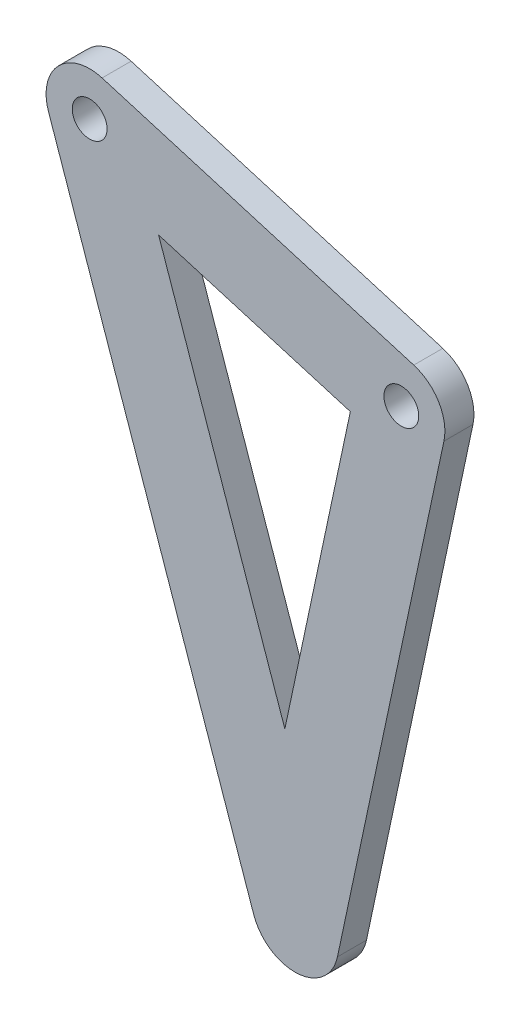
from build123d import *

# Parameters (mm, degrees)
BOSS_EXTRU_1_DEPTH           = 5
ENL_V_MAT_EXTRU_1_DEPTH      = 209.982344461
ENL_V_MAT_EXTRU_1_DEPTH_BACK = 209.982344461
ESQUISSE2_R                  = 3


with BuildPart() as part:
    # Esquisse1 → Boss.-Extru.1 (new body)
    with BuildSketch(Plane.XY):
        with BuildLine():
            Line((-145.396458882, -42.525932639), (-110.058903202, -144.581099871))
            ThreePointArc((-110.058903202, -144.581099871), (-102.508982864, -149.612813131), (-95.636285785, -143.689514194))
            Line((-95.636285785, -143.689514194), (-77.303993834, -57.620198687))
            ThreePointArc((-77.303993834, -57.620198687), (-78.190205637, -52.229303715), (-82.498484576, -48.86986142))
            Line((-82.498484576, -48.86986142), (-136.168332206, -32.884009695))
            ThreePointArc((-136.168332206, -32.884009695), (-143.727587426, -34.88617621), (-145.396458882, -42.525932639))
        make_face()
        Polygon((-93.41759999, -61.268790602), (-104.696691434, -114.223635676), (-126.438409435, -51.433365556), align=None, mode=Mode.SUBTRACT)
    extrude(amount=-BOSS_EXTRU_1_DEPTH)

    # Esquisse2 → Enl_v. mat.-Extru.1 (cut, two sides: drawn at the far end of the back side and taken through both)
    with BuildSketch(Plane.XY.offset(-ENL_V_MAT_EXTRU_1_DEPTH_BACK)):
        with Locations((-84.63944686, -56.057787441)):
            Circle(ESQUISSE2_R)
        with Locations((-138.309294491, -40.071935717)):
            Circle(ESQUISSE2_R)
    extrude(amount=ENL_V_MAT_EXTRU_1_DEPTH + ENL_V_MAT_EXTRU_1_DEPTH_BACK, mode=Mode.SUBTRACT)


solid = part.part
